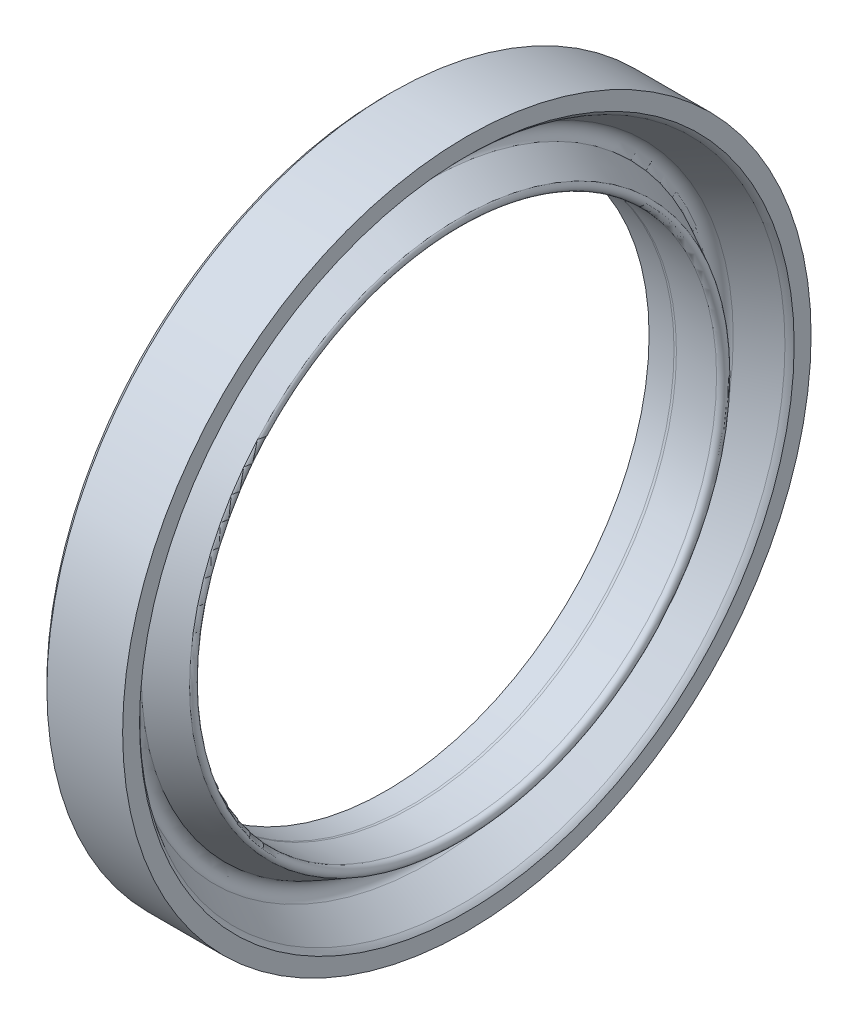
ISO-10303-21;
HEADER;
FILE_DESCRIPTION(('STEP AP214'),'2;1');
FILE_NAME('part.step','',(''),(''),'','','');
FILE_SCHEMA(('AUTOMOTIVE_DESIGN { 1 0 10303 214 1 1 1 1 }'));
ENDSEC;
DATA;
#1=APPLICATION_CONTEXT('core data for automotive mechanical design processes');
#2=APPLICATION_PROTOCOL_DEFINITION('international standard','automotive_design',2000,#1);
#3=PRODUCT_CONTEXT('',#1,'mechanical');
#4=PRODUCT('Part','Part','',(#3));
#5=PRODUCT_RELATED_PRODUCT_CATEGORY('part','',(#4));
#6=PRODUCT_DEFINITION_FORMATION('','',#4);
#7=PRODUCT_DEFINITION_CONTEXT('part definition',#1,'design');
#8=PRODUCT_DEFINITION('design','',#6,#7);
#9=PRODUCT_DEFINITION_SHAPE('','',#8);
#10=(LENGTH_UNIT() NAMED_UNIT(*) SI_UNIT(.MILLI.,.METRE.));
#11=(NAMED_UNIT(*) PLANE_ANGLE_UNIT() SI_UNIT($,.RADIAN.));
#12=(NAMED_UNIT(*) SI_UNIT($,.STERADIAN.) SOLID_ANGLE_UNIT());
#13=UNCERTAINTY_MEASURE_WITH_UNIT(LENGTH_MEASURE(1.E-05),#10,'distance_accuracy_value','');
#14=(GEOMETRIC_REPRESENTATION_CONTEXT(3) GLOBAL_UNCERTAINTY_ASSIGNED_CONTEXT((#13)) GLOBAL_UNIT_ASSIGNED_CONTEXT((#10,
#11,#12)) REPRESENTATION_CONTEXT('',''));
#15=CARTESIAN_POINT('',(0.,0.,0.));
#16=DIRECTION('',(0.,0.,1.));
#17=DIRECTION('',(1.,0.,0.));
#18=AXIS2_PLACEMENT_3D('',#15,#16,#17);
#19=CARTESIAN_POINT('',(-1.97330535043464,0.,0.));
#20=DIRECTION('',(1.,0.,0.));
#21=DIRECTION('',(0.,0.,-1.));
#22=AXIS2_PLACEMENT_3D('',#19,#20,#21);
#23=TOROIDAL_SURFACE('',#22,42.1079413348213,2.79627721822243);
#24=CARTESIAN_POINT('',(-0.324999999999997,0.,0.));
#25=DIRECTION('',(1.,0.,0.));
#26=DIRECTION('',(0.,0.,-1.));
#27=AXIS2_PLACEMENT_3D('',#24,#25,#26);
#28=CIRCLE('',#27,39.8491239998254);
#29=CARTESIAN_POINT('',(-0.324999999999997,0.,-39.8491239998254));
#30=VERTEX_POINT('',#29);
#31=EDGE_CURVE('E10',#30,#30,#28,.T.);
#32=ORIENTED_EDGE('',*,*,#31,.F.);
#33=EDGE_LOOP('',(#32));
#34=FACE_BOUND('',#33,.T.);
#35=CARTESIAN_POINT('',(0.249999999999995,0.,0.));
#36=DIRECTION('',(1.,0.,0.));
#37=DIRECTION('',(0.,0.,-1.));
#38=AXIS2_PLACEMENT_3D('',#35,#36,#37);
#39=CIRCLE('',#38,40.4120405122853);
#40=CARTESIAN_POINT('',(0.249999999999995,0.,-40.4120405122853));
#41=VERTEX_POINT('',#40);
#42=EDGE_CURVE('E69',#41,#41,#39,.T.);
#43=ORIENTED_EDGE('',*,*,#42,.T.);
#44=EDGE_LOOP('',(#43));
#45=FACE_BOUND('',#44,.T.);
#46=ADVANCED_FACE('F29',(#34,#45),#23,.T.);
#47=CARTESIAN_POINT('',(-0.324999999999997,0.,0.));
#48=DIRECTION('',(1.,0.,0.));
#49=DIRECTION('',(0.,0.,-1.));
#50=AXIS2_PLACEMENT_3D('',#47,#48,#49);
#51=CONICAL_SURFACE('',#50,39.8491239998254,0.523598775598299);
#52=CARTESIAN_POINT('',(-4.37410515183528,0.,0.));
#53=DIRECTION('',(1.,0.,0.));
#54=DIRECTION('',(0.,0.,-1.));
#55=AXIS2_PLACEMENT_3D('',#52,#53,#54);
#56=CIRCLE('',#55,37.5113720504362);
#57=CARTESIAN_POINT('',(-4.37410515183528,0.,-37.5113720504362));
#58=VERTEX_POINT('',#57);
#59=EDGE_CURVE('E35',#58,#58,#56,.T.);
#60=ORIENTED_EDGE('',*,*,#59,.F.);
#61=EDGE_LOOP('',(#60));
#62=FACE_BOUND('',#61,.T.);
#63=ORIENTED_EDGE('',*,*,#31,.T.);
#64=EDGE_LOOP('',(#63));
#65=FACE_BOUND('',#64,.T.);
#66=ADVANCED_FACE('F130',(#62,#65),#51,.F.);
#67=CARTESIAN_POINT('',(-3.72410515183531,0.,0.));
#68=DIRECTION('',(1.,0.,0.));
#69=DIRECTION('',(0.,0.,-1.));
#70=AXIS2_PLACEMENT_3D('',#67,#68,#69);
#71=TOROIDAL_SURFACE('',#70,36.3855390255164,1.29999999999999);
#72=CARTESIAN_POINT('',(-4.55972904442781,0.,0.));
#73=DIRECTION('',(1.,0.,0.));
#74=DIRECTION('',(0.,0.,-1.));
#75=AXIS2_PLACEMENT_3D('',#72,#73,#74);
#76=CIRCLE('',#75,35.3896812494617);
#77=CARTESIAN_POINT('',(-4.55972904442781,0.,-35.3896812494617));
#78=VERTEX_POINT('',#77);
#79=EDGE_CURVE('E39',#78,#78,#76,.T.);
#80=ORIENTED_EDGE('',*,*,#79,.F.);
#81=EDGE_LOOP('',(#80));
#82=FACE_BOUND('',#81,.T.);
#83=ORIENTED_EDGE('',*,*,#59,.T.);
#84=EDGE_LOOP('',(#83));
#85=FACE_BOUND('',#84,.T.);
#86=ADVANCED_FACE('F125',(#82,#85),#71,.F.);
#87=CARTESIAN_POINT('',(-4.55972904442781,0.,0.));
#88=DIRECTION('',(-1.,0.,0.));
#89=DIRECTION('',(0.,0.,1.));
#90=AXIS2_PLACEMENT_3D('',#87,#88,#89);
#91=CONICAL_SURFACE('',#90,35.3896812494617,0.478196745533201);
#92=CARTESIAN_POINT('',(-0.636042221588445,0.,0.));
#93=DIRECTION('',(1.,0.,0.));
#94=DIRECTION('',(0.,0.,-1.));
#95=AXIS2_PLACEMENT_3D('',#92,#93,#94);
#96=CIRCLE('',#95,33.3559520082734);
#97=CARTESIAN_POINT('',(-0.636042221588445,0.,-33.3559520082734));
#98=VERTEX_POINT('',#97);
#99=EDGE_CURVE('E43',#98,#98,#96,.T.);
#100=ORIENTED_EDGE('',*,*,#99,.F.);
#101=EDGE_LOOP('',(#100));
#102=FACE_BOUND('',#101,.T.);
#103=ORIENTED_EDGE('',*,*,#79,.T.);
#104=EDGE_LOOP('',(#103));
#105=FACE_BOUND('',#104,.T.);
#106=ADVANCED_FACE('F119',(#102,#105),#91,.T.);
#107=CARTESIAN_POINT('',(-1.03583740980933,0.,0.));
#108=DIRECTION('',(1.,0.,0.));
#109=DIRECTION('',(0.,0.,-1.));
#110=AXIS2_PLACEMENT_3D('',#107,#108,#109);
#111=TOROIDAL_SURFACE('',#110,32.8794946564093,0.621970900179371);
#112=CARTESIAN_POINT('',(-1.19681532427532,0.,0.));
#113=DIRECTION('',(1.,0.,0.));
#114=DIRECTION('',(0.,0.,-1.));
#115=AXIS2_PLACEMENT_3D('',#112,#113,#114);
#116=CIRCLE('',#115,32.2787169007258);
#117=CARTESIAN_POINT('',(-1.19681532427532,0.,-32.2787169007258));
#118=VERTEX_POINT('',#117);
#119=EDGE_CURVE('E48',#118,#118,#116,.T.);
#120=ORIENTED_EDGE('',*,*,#119,.F.);
#121=EDGE_LOOP('',(#120));
#122=FACE_BOUND('',#121,.T.);
#123=ORIENTED_EDGE('',*,*,#99,.T.);
#124=EDGE_LOOP('',(#123));
#125=FACE_BOUND('',#124,.T.);
#126=ADVANCED_FACE('F113',(#122,#125),#111,.T.);
#127=CARTESIAN_POINT('',(-1.19681532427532,0.,0.));
#128=DIRECTION('',(-1.,0.,0.));
#129=DIRECTION('',(0.,0.,1.));
#130=AXIS2_PLACEMENT_3D('',#127,#128,#129);
#131=CONICAL_SURFACE('',#130,32.2787169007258,0.0344338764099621);
#132=CARTESIAN_POINT('',(-6.33468348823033,0.,0.));
#133=DIRECTION('',(1.,0.,0.));
#134=DIRECTION('',(0.,0.,-1.));
#135=AXIS2_PLACEMENT_3D('',#132,#133,#134);
#136=CIRCLE('',#135,32.4557035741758);
#137=CARTESIAN_POINT('',(-6.33468348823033,0.,-32.4557035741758));
#138=VERTEX_POINT('',#137);
#139=EDGE_CURVE('E51',#138,#138,#136,.T.);
#140=ORIENTED_EDGE('',*,*,#139,.F.);
#141=EDGE_LOOP('',(#140));
#142=FACE_BOUND('',#141,.T.);
#143=ORIENTED_EDGE('',*,*,#119,.T.);
#144=EDGE_LOOP('',(#143));
#145=FACE_BOUND('',#144,.T.);
#146=ADVANCED_FACE('F107',(#142,#145),#131,.F.);
#147=CARTESIAN_POINT('',(-6.67114824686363,0.,0.));
#148=DIRECTION('',(1.,0.,0.));
#149=DIRECTION('',(0.,0.,-1.));
#150=AXIS2_PLACEMENT_3D('',#147,#148,#149);
#151=TOROIDAL_SURFACE('',#150,31.2,1.3);
#152=CARTESIAN_POINT('',(-6.67114824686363,0.,0.));
#153=DIRECTION('',(1.,0.,0.));
#154=DIRECTION('',(0.,0.,-1.));
#155=AXIS2_PLACEMENT_3D('',#152,#153,#154);
#156=CIRCLE('',#155,32.5);
#157=CARTESIAN_POINT('',(-6.67114824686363,0.,-32.5));
#158=VERTEX_POINT('',#157);
#159=EDGE_CURVE('E54',#158,#158,#156,.T.);
#160=ORIENTED_EDGE('',*,*,#159,.F.);
#161=EDGE_LOOP('',(#160));
#162=FACE_BOUND('',#161,.T.);
#163=ORIENTED_EDGE('',*,*,#139,.T.);
#164=EDGE_LOOP('',(#163));
#165=FACE_BOUND('',#164,.T.);
#166=ADVANCED_FACE('F101',(#162,#165),#151,.F.);
#167=CARTESIAN_POINT('',(2.43404063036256,0.,0.));
#168=DIRECTION('',(1.,0.,0.));
#169=DIRECTION('',(0.,0.,-1.));
#170=AXIS2_PLACEMENT_3D('',#167,#168,#169);
#171=CYLINDRICAL_SURFACE('',#170,32.5);
#172=CARTESIAN_POINT('',(-9.75000000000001,0.,0.));
#173=DIRECTION('',(1.,0.,0.));
#174=DIRECTION('',(0.,0.,-1.));
#175=AXIS2_PLACEMENT_3D('',#172,#173,#174);
#176=CIRCLE('',#175,32.5);
#177=CARTESIAN_POINT('',(-9.75000000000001,0.,-32.5));
#178=VERTEX_POINT('',#177);
#179=EDGE_CURVE('E57',#178,#178,#176,.T.);
#180=ORIENTED_EDGE('',*,*,#179,.F.);
#181=EDGE_LOOP('',(#180));
#182=FACE_BOUND('',#181,.T.);
#183=ORIENTED_EDGE('',*,*,#159,.T.);
#184=EDGE_LOOP('',(#183));
#185=FACE_BOUND('',#184,.T.);
#186=ADVANCED_FACE('F95',(#182,#185),#171,.F.);
#187=CARTESIAN_POINT('',(-9.75000000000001,-41.85,0.));
#188=DIRECTION('',(1.,0.,0.));
#189=DIRECTION('',(0.,0.,-1.));
#190=AXIS2_PLACEMENT_3D('',#187,#188,#189);
#191=PLANE('',#190);
#192=CARTESIAN_POINT('',(-9.75000000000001,0.,0.));
#193=DIRECTION('',(1.,0.,0.));
#194=DIRECTION('',(0.,0.,-1.));
#195=AXIS2_PLACEMENT_3D('',#192,#193,#194);
#196=CIRCLE('',#195,41.85);
#197=CARTESIAN_POINT('',(-9.75000000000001,0.,-41.85));
#198=VERTEX_POINT('',#197);
#199=EDGE_CURVE('E60',#198,#198,#196,.T.);
#200=ORIENTED_EDGE('',*,*,#199,.F.);
#201=EDGE_LOOP('',(#200));
#202=FACE_BOUND('',#201,.T.);
#203=ORIENTED_EDGE('',*,*,#179,.T.);
#204=EDGE_LOOP('',(#203));
#205=FACE_BOUND('',#204,.T.);
#206=ADVANCED_FACE('F89',(#202,#205),#191,.F.);
#207=CARTESIAN_POINT('',(-9.75000000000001,0.,0.));
#208=DIRECTION('',(1.,0.,0.));
#209=DIRECTION('',(0.,0.,-1.));
#210=AXIS2_PLACEMENT_3D('',#207,#208,#209);
#211=CONICAL_SURFACE('',#210,41.85,0.785398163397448);
#212=CARTESIAN_POINT('',(-9.09999999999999,0.,0.));
#213=DIRECTION('',(1.,0.,0.));
#214=DIRECTION('',(0.,0.,-1.));
#215=AXIS2_PLACEMENT_3D('',#212,#213,#214);
#216=CIRCLE('',#215,42.5);
#217=CARTESIAN_POINT('',(-9.09999999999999,0.,-42.5));
#218=VERTEX_POINT('',#217);
#219=EDGE_CURVE('E63',#218,#218,#216,.T.);
#220=ORIENTED_EDGE('',*,*,#219,.F.);
#221=EDGE_LOOP('',(#220));
#222=FACE_BOUND('',#221,.T.);
#223=ORIENTED_EDGE('',*,*,#199,.T.);
#224=EDGE_LOOP('',(#223));
#225=FACE_BOUND('',#224,.T.);
#226=ADVANCED_FACE('F83',(#222,#225),#211,.T.);
#227=CARTESIAN_POINT('',(2.43404063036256,0.,0.));
#228=DIRECTION('',(1.,0.,0.));
#229=DIRECTION('',(0.,0.,-1.));
#230=AXIS2_PLACEMENT_3D('',#227,#228,#229);
#231=CYLINDRICAL_SURFACE('',#230,42.5);
#232=CARTESIAN_POINT('',(0.249999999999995,0.,0.));
#233=DIRECTION('',(1.,0.,0.));
#234=DIRECTION('',(0.,0.,-1.));
#235=AXIS2_PLACEMENT_3D('',#232,#233,#234);
#236=CIRCLE('',#235,42.5);
#237=CARTESIAN_POINT('',(0.249999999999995,0.,-42.5));
#238=VERTEX_POINT('',#237);
#239=EDGE_CURVE('E66',#238,#238,#236,.T.);
#240=ORIENTED_EDGE('',*,*,#239,.F.);
#241=EDGE_LOOP('',(#240));
#242=FACE_BOUND('',#241,.T.);
#243=ORIENTED_EDGE('',*,*,#219,.T.);
#244=EDGE_LOOP('',(#243));
#245=FACE_BOUND('',#244,.T.);
#246=ADVANCED_FACE('F77',(#242,#245),#231,.T.);
#247=CARTESIAN_POINT('',(0.249999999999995,-42.5,0.));
#248=DIRECTION('',(-1.,0.,0.));
#249=DIRECTION('',(0.,0.,1.));
#250=AXIS2_PLACEMENT_3D('',#247,#248,#249);
#251=PLANE('',#250);
#252=ORIENTED_EDGE('',*,*,#42,.F.);
#253=EDGE_LOOP('',(#252));
#254=FACE_BOUND('',#253,.T.);
#255=ORIENTED_EDGE('',*,*,#239,.T.);
#256=EDGE_LOOP('',(#255));
#257=FACE_BOUND('',#256,.T.);
#258=ADVANCED_FACE('F74',(#254,#257),#251,.F.);
#259=CLOSED_SHELL('',(#46,#66,#86,#106,#126,#146,#166,#186,#206,#226,#246,#258));
#260=MANIFOLD_SOLID_BREP('B2',#259);
#261=ADVANCED_BREP_SHAPE_REPRESENTATION('',(#18,#260),#14);
#262=SHAPE_DEFINITION_REPRESENTATION(#9,#261);
ENDSEC;
END-ISO-10303-21;
